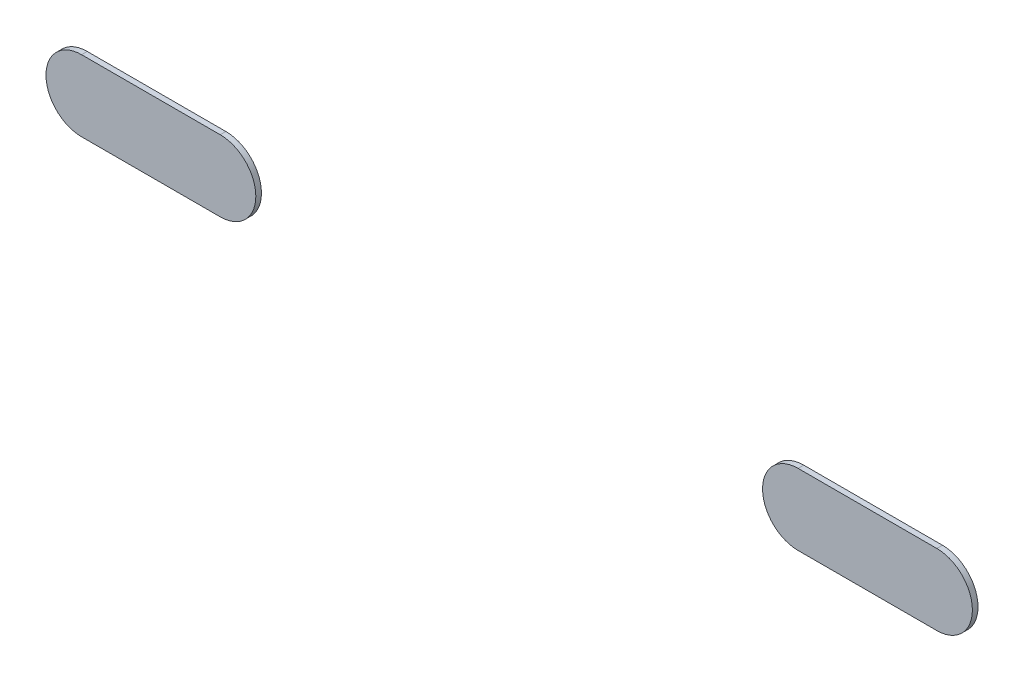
ISO-10303-21;
HEADER;
FILE_DESCRIPTION(('STEP AP214'),'2;1');
FILE_NAME('part.step','',(''),(''),'','','');
FILE_SCHEMA(('AUTOMOTIVE_DESIGN { 1 0 10303 214 1 1 1 1 }'));
ENDSEC;
DATA;
#1=APPLICATION_CONTEXT('core data for automotive mechanical design processes');
#2=APPLICATION_PROTOCOL_DEFINITION('international standard','automotive_design',2000,#1);
#3=PRODUCT_CONTEXT('',#1,'mechanical');
#4=PRODUCT('Part','Part','',(#3));
#5=PRODUCT_RELATED_PRODUCT_CATEGORY('part','',(#4));
#6=PRODUCT_DEFINITION_FORMATION('','',#4);
#7=PRODUCT_DEFINITION_CONTEXT('part definition',#1,'design');
#8=PRODUCT_DEFINITION('design','',#6,#7);
#9=PRODUCT_DEFINITION_SHAPE('','',#8);
#10=(LENGTH_UNIT() NAMED_UNIT(*) SI_UNIT(.MILLI.,.METRE.));
#11=(NAMED_UNIT(*) PLANE_ANGLE_UNIT() SI_UNIT($,.RADIAN.));
#12=(NAMED_UNIT(*) SI_UNIT($,.STERADIAN.) SOLID_ANGLE_UNIT());
#13=UNCERTAINTY_MEASURE_WITH_UNIT(LENGTH_MEASURE(1.E-05),#10,'distance_accuracy_value','');
#14=(GEOMETRIC_REPRESENTATION_CONTEXT(3) GLOBAL_UNCERTAINTY_ASSIGNED_CONTEXT((#13)) GLOBAL_UNIT_ASSIGNED_CONTEXT((#10,
#11,#12)) REPRESENTATION_CONTEXT('',''));
#15=CARTESIAN_POINT('',(0.,0.,0.));
#16=DIRECTION('',(0.,0.,1.));
#17=DIRECTION('',(1.,0.,0.));
#18=AXIS2_PLACEMENT_3D('',#15,#16,#17);
#19=CARTESIAN_POINT('',(-6.37337640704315,24.7985651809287,0.));
#20=DIRECTION('',(0.,0.,1.));
#21=DIRECTION('',(1.,0.,0.));
#22=AXIS2_PLACEMENT_3D('',#19,#20,#21);
#23=PLANE('',#22);
#24=CARTESIAN_POINT('',(-5.14110466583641,24.7985651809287,0.));
#25=DIRECTION('',(0.,0.,1.));
#26=DIRECTION('',(1.,0.,0.));
#27=AXIS2_PLACEMENT_3D('',#24,#25,#26);
#28=CIRCLE('',#27,0.631929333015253);
#29=CARTESIAN_POINT('',(-5.14110466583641,24.1666358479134,0.));
#30=VERTEX_POINT('',#29);
#31=CARTESIAN_POINT('',(-5.14110466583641,25.4304945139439,0.));
#32=VERTEX_POINT('',#31);
#33=EDGE_CURVE('P0_E59',#30,#32,#28,.T.);
#34=ORIENTED_EDGE('',*,*,#33,.F.);
#35=DIRECTION('',(1.,0.,0.));
#36=VECTOR('',#35,1.);
#37=CARTESIAN_POINT('',(-7.60562901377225,24.1666358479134,0.));
#38=LINE('',#37,#36);
#39=CARTESIAN_POINT('',(-7.60562901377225,24.1666358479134,0.));
#40=VERTEX_POINT('',#39);
#41=EDGE_CURVE('P0_E57',#40,#30,#38,.T.);
#42=ORIENTED_EDGE('',*,*,#41,.F.);
#43=CARTESIAN_POINT('',(-7.60562901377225,24.7985651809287,0.));
#44=DIRECTION('',(0.,0.,1.));
#45=DIRECTION('',(1.,0.,0.));
#46=AXIS2_PLACEMENT_3D('',#43,#44,#45);
#47=CIRCLE('',#46,0.631929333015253);
#48=CARTESIAN_POINT('',(-7.60562901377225,25.4304945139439,0.));
#49=VERTEX_POINT('',#48);
#50=EDGE_CURVE('P0_E20',#49,#40,#47,.T.);
#51=ORIENTED_EDGE('',*,*,#50,.F.);
#52=DIRECTION('',(1.,0.,0.));
#53=VECTOR('',#52,1.);
#54=CARTESIAN_POINT('',(-5.14110466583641,25.4304945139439,0.));
#55=LINE('',#54,#53);
#56=EDGE_CURVE('P0_E68',#32,#49,#55,.F.);
#57=ORIENTED_EDGE('',*,*,#56,.F.);
#58=EDGE_LOOP('',(#34,#42,#51,#57));
#59=FACE_BOUND('',#58,.T.);
#60=ADVANCED_FACE('P0_F16',(#59),#23,.F.);
#61=CARTESIAN_POINT('',(-5.14110466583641,25.4304945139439,0.));
#62=DIRECTION('',(0.,1.,0.));
#63=DIRECTION('',(0.,0.,1.));
#64=AXIS2_PLACEMENT_3D('',#61,#62,#63);
#65=PLANE('',#64);
#66=DIRECTION('',(1.,0.,0.));
#67=VECTOR('',#66,1.);
#68=CARTESIAN_POINT('',(-6.37337640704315,25.4304945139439,0.1));
#69=LINE('',#68,#67);
#70=CARTESIAN_POINT('',(-5.14110466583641,25.4304945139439,0.1));
#71=VERTEX_POINT('',#70);
#72=CARTESIAN_POINT('',(-7.60562901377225,25.4304945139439,0.1));
#73=VERTEX_POINT('',#72);
#74=EDGE_CURVE('P0_E80',#71,#73,#69,.F.);
#75=ORIENTED_EDGE('',*,*,#74,.F.);
#76=DIRECTION('',(0.,0.,1.));
#77=VECTOR('',#76,1.);
#78=CARTESIAN_POINT('',(-5.14110466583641,25.430494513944,0.));
#79=LINE('',#78,#77);
#80=EDGE_CURVE('P0_E73',#32,#71,#79,.T.);
#81=ORIENTED_EDGE('',*,*,#80,.F.);
#82=ORIENTED_EDGE('',*,*,#56,.T.);
#83=DIRECTION('',(0.,0.,1.));
#84=VECTOR('',#83,1.);
#85=CARTESIAN_POINT('',(-7.60562901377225,25.430494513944,0.));
#86=LINE('',#85,#84);
#87=EDGE_CURVE('P0_E62',#73,#49,#86,.F.);
#88=ORIENTED_EDGE('',*,*,#87,.F.);
#89=EDGE_LOOP('',(#75,#81,#82,#88));
#90=FACE_BOUND('',#89,.T.);
#91=ADVANCED_FACE('P0_F102',(#90),#65,.T.);
#92=CARTESIAN_POINT('',(-7.60562901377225,24.7985651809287,0.));
#93=DIRECTION('',(0.,0.,1.));
#94=DIRECTION('',(1.,0.,0.));
#95=AXIS2_PLACEMENT_3D('',#92,#93,#94);
#96=CYLINDRICAL_SURFACE('',#95,0.631929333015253);
#97=CARTESIAN_POINT('',(-7.60562901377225,24.7985651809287,0.1));
#98=DIRECTION('',(0.,0.,1.));
#99=DIRECTION('',(1.,0.,0.));
#100=AXIS2_PLACEMENT_3D('',#97,#98,#99);
#101=CIRCLE('',#100,0.631929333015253);
#102=CARTESIAN_POINT('',(-7.60562901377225,24.1666358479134,0.1));
#103=VERTEX_POINT('',#102);
#104=EDGE_CURVE('P0_E79',#73,#103,#101,.T.);
#105=ORIENTED_EDGE('',*,*,#104,.F.);
#106=ORIENTED_EDGE('',*,*,#87,.T.);
#107=ORIENTED_EDGE('',*,*,#50,.T.);
#108=DIRECTION('',(0.,0.,-1.));
#109=VECTOR('',#108,1.);
#110=CARTESIAN_POINT('',(-7.60562901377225,24.1666358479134,0.));
#111=LINE('',#110,#109);
#112=EDGE_CURVE('P0_E61',#103,#40,#111,.T.);
#113=ORIENTED_EDGE('',*,*,#112,.F.);
#114=EDGE_LOOP('',(#105,#106,#107,#113));
#115=FACE_BOUND('',#114,.T.);
#116=ADVANCED_FACE('P0_F67',(#115),#96,.T.);
#117=CARTESIAN_POINT('',(-7.60562901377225,24.1666358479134,0.));
#118=DIRECTION('',(0.,-1.,0.));
#119=DIRECTION('',(0.,0.,-1.));
#120=AXIS2_PLACEMENT_3D('',#117,#118,#119);
#121=PLANE('',#120);
#122=DIRECTION('',(1.,0.,0.));
#123=VECTOR('',#122,1.);
#124=CARTESIAN_POINT('',(-6.37337640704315,24.1666358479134,0.1));
#125=LINE('',#124,#123);
#126=CARTESIAN_POINT('',(-5.14110466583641,24.1666358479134,0.1));
#127=VERTEX_POINT('',#126);
#128=EDGE_CURVE('P0_E26',#103,#127,#125,.T.);
#129=ORIENTED_EDGE('',*,*,#128,.F.);
#130=ORIENTED_EDGE('',*,*,#112,.T.);
#131=ORIENTED_EDGE('',*,*,#41,.T.);
#132=DIRECTION('',(0.,0.,1.));
#133=VECTOR('',#132,1.);
#134=CARTESIAN_POINT('',(-5.14110466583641,24.1666358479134,0.));
#135=LINE('',#134,#133);
#136=EDGE_CURVE('P0_E35',#127,#30,#135,.F.);
#137=ORIENTED_EDGE('',*,*,#136,.F.);
#138=EDGE_LOOP('',(#129,#130,#131,#137));
#139=FACE_BOUND('',#138,.T.);
#140=ADVANCED_FACE('P0_F69',(#139),#121,.T.);
#141=CARTESIAN_POINT('',(-5.14110466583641,24.7985651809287,0.));
#142=DIRECTION('',(0.,0.,1.));
#143=DIRECTION('',(1.,0.,0.));
#144=AXIS2_PLACEMENT_3D('',#141,#142,#143);
#145=CYLINDRICAL_SURFACE('',#144,0.631929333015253);
#146=CARTESIAN_POINT('',(-5.14110466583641,24.7985651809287,0.1));
#147=DIRECTION('',(0.,0.,1.));
#148=DIRECTION('',(1.,0.,0.));
#149=AXIS2_PLACEMENT_3D('',#146,#147,#148);
#150=CIRCLE('',#149,0.631929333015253);
#151=EDGE_CURVE('P0_E11',#127,#71,#150,.T.);
#152=ORIENTED_EDGE('',*,*,#151,.F.);
#153=ORIENTED_EDGE('',*,*,#136,.T.);
#154=ORIENTED_EDGE('',*,*,#33,.T.);
#155=ORIENTED_EDGE('',*,*,#80,.T.);
#156=EDGE_LOOP('',(#152,#153,#154,#155));
#157=FACE_BOUND('',#156,.T.);
#158=ADVANCED_FACE('P0_F88',(#157),#145,.T.);
#159=CARTESIAN_POINT('',(-6.37337640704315,24.7985651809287,0.1));
#160=DIRECTION('',(0.,0.,1.));
#161=DIRECTION('',(1.,0.,0.));
#162=AXIS2_PLACEMENT_3D('',#159,#160,#161);
#163=PLANE('',#162);
#164=ORIENTED_EDGE('',*,*,#128,.T.);
#165=ORIENTED_EDGE('',*,*,#151,.T.);
#166=ORIENTED_EDGE('',*,*,#74,.T.);
#167=ORIENTED_EDGE('',*,*,#104,.T.);
#168=EDGE_LOOP('',(#164,#165,#166,#167));
#169=FACE_BOUND('',#168,.T.);
#170=ADVANCED_FACE('P0_F18',(#169),#163,.T.);
#171=CLOSED_SHELL('',(#60,#91,#116,#140,#158,#170));
#172=MANIFOLD_SOLID_BREP('P0_B1',#171);
#173=CARTESIAN_POINT('',(6.36001849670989,24.7985651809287,0.1));
#174=DIRECTION('',(0.,0.,1.));
#175=DIRECTION('',(1.,0.,0.));
#176=AXIS2_PLACEMENT_3D('',#173,#174,#175);
#177=PLANE('',#176);
#178=DIRECTION('',(1.,0.,0.));
#179=VECTOR('',#178,1.);
#180=CARTESIAN_POINT('',(5.12774675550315,24.1666358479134,0.1));
#181=LINE('',#180,#179);
#182=CARTESIAN_POINT('',(7.592271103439,24.1666358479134,0.1));
#183=VERTEX_POINT('',#182);
#184=CARTESIAN_POINT('',(5.12774675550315,24.1666358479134,0.1));
#185=VERTEX_POINT('',#184);
#186=EDGE_CURVE('P1_E53',#183,#185,#181,.F.);
#187=ORIENTED_EDGE('',*,*,#186,.F.);
#188=CARTESIAN_POINT('',(7.592271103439,24.7985651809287,0.1));
#189=DIRECTION('',(0.,0.,1.));
#190=DIRECTION('',(1.,0.,0.));
#191=AXIS2_PLACEMENT_3D('',#188,#189,#190);
#192=CIRCLE('',#191,0.631929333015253);
#193=CARTESIAN_POINT('',(7.592271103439,25.4304945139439,0.1));
#194=VERTEX_POINT('',#193);
#195=EDGE_CURVE('P1_E73',#194,#183,#192,.F.);
#196=ORIENTED_EDGE('',*,*,#195,.F.);
#197=DIRECTION('',(1.,0.,0.));
#198=VECTOR('',#197,1.);
#199=CARTESIAN_POINT('',(7.592271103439,25.4304945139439,0.1));
#200=LINE('',#199,#198);
#201=CARTESIAN_POINT('',(5.12774675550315,25.4304945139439,0.1));
#202=VERTEX_POINT('',#201);
#203=EDGE_CURVE('P1_E66',#202,#194,#200,.T.);
#204=ORIENTED_EDGE('',*,*,#203,.F.);
#205=CARTESIAN_POINT('',(5.12774675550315,24.7985651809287,0.1));
#206=DIRECTION('',(0.,0.,1.));
#207=DIRECTION('',(1.,0.,0.));
#208=AXIS2_PLACEMENT_3D('',#205,#206,#207);
#209=CIRCLE('',#208,0.631929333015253);
#210=EDGE_CURVE('P1_E19',#185,#202,#209,.F.);
#211=ORIENTED_EDGE('',*,*,#210,.F.);
#212=EDGE_LOOP('',(#187,#196,#204,#211));
#213=FACE_BOUND('',#212,.T.);
#214=ADVANCED_FACE('P1_F15',(#213),#177,.T.);
#215=CARTESIAN_POINT('',(5.12774675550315,24.7985651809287,0.));
#216=DIRECTION('',(0.,0.,1.));
#217=DIRECTION('',(1.,0.,0.));
#218=AXIS2_PLACEMENT_3D('',#215,#216,#217);
#219=CYLINDRICAL_SURFACE('',#218,0.631929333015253);
#220=ORIENTED_EDGE('',*,*,#210,.T.);
#221=DIRECTION('',(0.,0.,1.));
#222=VECTOR('',#221,1.);
#223=CARTESIAN_POINT('',(5.12774675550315,25.4304945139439,0.));
#224=LINE('',#223,#222);
#225=CARTESIAN_POINT('',(5.12774675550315,25.4304945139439,0.));
#226=VERTEX_POINT('',#225);
#227=EDGE_CURVE('P1_E78',#226,#202,#224,.T.);
#228=ORIENTED_EDGE('',*,*,#227,.F.);
#229=CARTESIAN_POINT('',(5.12774675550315,24.7985651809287,0.));
#230=DIRECTION('',(0.,0.,1.));
#231=DIRECTION('',(1.,0.,0.));
#232=AXIS2_PLACEMENT_3D('',#229,#230,#231);
#233=CIRCLE('',#232,0.631929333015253);
#234=CARTESIAN_POINT('',(5.12774675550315,24.1666358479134,0.));
#235=VERTEX_POINT('',#234);
#236=EDGE_CURVE('P1_E72',#226,#235,#233,.T.);
#237=ORIENTED_EDGE('',*,*,#236,.T.);
#238=DIRECTION('',(0.,0.,-1.));
#239=VECTOR('',#238,1.);
#240=CARTESIAN_POINT('',(5.12774675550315,24.1666358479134,0.));
#241=LINE('',#240,#239);
#242=EDGE_CURVE('P1_E58',#185,#235,#241,.T.);
#243=ORIENTED_EDGE('',*,*,#242,.F.);
#244=EDGE_LOOP('',(#220,#228,#237,#243));
#245=FACE_BOUND('',#244,.T.);
#246=ADVANCED_FACE('P1_F71',(#245),#219,.T.);
#247=CARTESIAN_POINT('',(5.12774675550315,24.1666358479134,0.));
#248=DIRECTION('',(0.,-1.,0.));
#249=DIRECTION('',(0.,0.,-1.));
#250=AXIS2_PLACEMENT_3D('',#247,#248,#249);
#251=PLANE('',#250);
#252=ORIENTED_EDGE('',*,*,#186,.T.);
#253=ORIENTED_EDGE('',*,*,#242,.T.);
#254=DIRECTION('',(1.,0.,0.));
#255=VECTOR('',#254,1.);
#256=CARTESIAN_POINT('',(6.36001849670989,24.1666358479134,0.));
#257=LINE('',#256,#255);
#258=CARTESIAN_POINT('',(7.592271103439,24.1666358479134,0.));
#259=VERTEX_POINT('',#258);
#260=EDGE_CURVE('P1_E82',#235,#259,#257,.T.);
#261=ORIENTED_EDGE('',*,*,#260,.T.);
#262=DIRECTION('',(0.,0.,1.));
#263=VECTOR('',#262,1.);
#264=CARTESIAN_POINT('',(7.592271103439,24.1666358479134,0.));
#265=LINE('',#264,#263);
#266=EDGE_CURVE('P1_E60',#183,#259,#265,.F.);
#267=ORIENTED_EDGE('',*,*,#266,.F.);
#268=EDGE_LOOP('',(#252,#253,#261,#267));
#269=FACE_BOUND('',#268,.T.);
#270=ADVANCED_FACE('P1_F55',(#269),#251,.T.);
#271=CARTESIAN_POINT('',(7.592271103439,24.7985651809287,0.));
#272=DIRECTION('',(0.,0.,1.));
#273=DIRECTION('',(1.,0.,0.));
#274=AXIS2_PLACEMENT_3D('',#271,#272,#273);
#275=CYLINDRICAL_SURFACE('',#274,0.631929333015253);
#276=ORIENTED_EDGE('',*,*,#195,.T.);
#277=ORIENTED_EDGE('',*,*,#266,.T.);
#278=CARTESIAN_POINT('',(7.592271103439,24.7985651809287,0.));
#279=DIRECTION('',(0.,0.,1.));
#280=DIRECTION('',(1.,0.,0.));
#281=AXIS2_PLACEMENT_3D('',#278,#279,#280);
#282=CIRCLE('',#281,0.631929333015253);
#283=CARTESIAN_POINT('',(7.592271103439,25.4304945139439,0.));
#284=VERTEX_POINT('',#283);
#285=EDGE_CURVE('P1_E25',#259,#284,#282,.T.);
#286=ORIENTED_EDGE('',*,*,#285,.T.);
#287=DIRECTION('',(0.,0.,1.));
#288=VECTOR('',#287,1.);
#289=CARTESIAN_POINT('',(7.592271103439,25.4304945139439,0.));
#290=LINE('',#289,#288);
#291=EDGE_CURVE('P1_E33',#194,#284,#290,.F.);
#292=ORIENTED_EDGE('',*,*,#291,.F.);
#293=EDGE_LOOP('',(#276,#277,#286,#292));
#294=FACE_BOUND('',#293,.T.);
#295=ADVANCED_FACE('P1_F87',(#294),#275,.T.);
#296=CARTESIAN_POINT('',(7.592271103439,25.4304945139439,0.));
#297=DIRECTION('',(0.,1.,0.));
#298=DIRECTION('',(0.,0.,1.));
#299=AXIS2_PLACEMENT_3D('',#296,#297,#298);
#300=PLANE('',#299);
#301=ORIENTED_EDGE('',*,*,#203,.T.);
#302=ORIENTED_EDGE('',*,*,#291,.T.);
#303=DIRECTION('',(1.,0.,0.));
#304=VECTOR('',#303,1.);
#305=CARTESIAN_POINT('',(6.36001849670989,25.4304945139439,0.));
#306=LINE('',#305,#304);
#307=EDGE_CURVE('P1_E10',#284,#226,#306,.F.);
#308=ORIENTED_EDGE('',*,*,#307,.T.);
#309=ORIENTED_EDGE('',*,*,#227,.T.);
#310=EDGE_LOOP('',(#301,#302,#308,#309));
#311=FACE_BOUND('',#310,.T.);
#312=ADVANCED_FACE('P1_F89',(#311),#300,.T.);
#313=CARTESIAN_POINT('',(6.36001849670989,24.7985651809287,0.));
#314=DIRECTION('',(0.,0.,1.));
#315=DIRECTION('',(1.,0.,0.));
#316=AXIS2_PLACEMENT_3D('',#313,#314,#315);
#317=PLANE('',#316);
#318=ORIENTED_EDGE('',*,*,#285,.F.);
#319=ORIENTED_EDGE('',*,*,#260,.F.);
#320=ORIENTED_EDGE('',*,*,#236,.F.);
#321=ORIENTED_EDGE('',*,*,#307,.F.);
#322=EDGE_LOOP('',(#318,#319,#320,#321));
#323=FACE_BOUND('',#322,.T.);
#324=ADVANCED_FACE('P1_F17',(#323),#317,.F.);
#325=CLOSED_SHELL('',(#214,#246,#270,#295,#312,#324));
#326=MANIFOLD_SOLID_BREP('P1_B1',#325);
#327=ADVANCED_BREP_SHAPE_REPRESENTATION('',(#18,#172,#326),#14);
#328=SHAPE_DEFINITION_REPRESENTATION(#9,#327);
ENDSEC;
END-ISO-10303-21;
